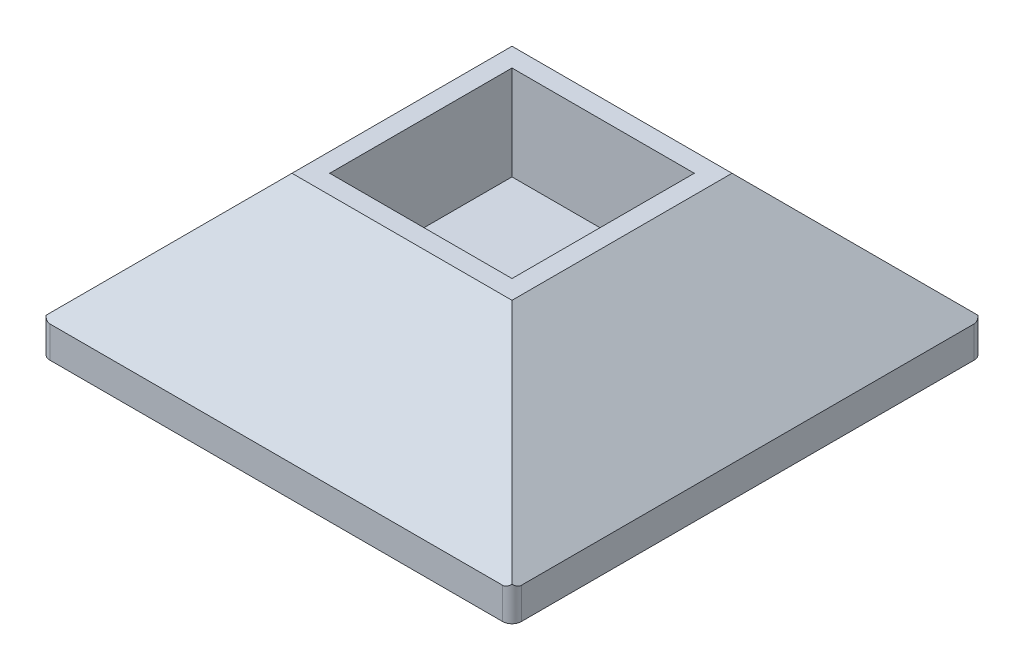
from build123d import *

# Parameters (mm, degrees)
SKETCH1_W           = 150
SKETCH1_H           = 150
BOSS_EXTRUDE1_DEPTH = 50
SKETCH2_W           = 58
SKETCH2_H           = 58
CUT_EXTRUDE1_DEPTH  = 30
CHAMFER1_SIZE       = 40
FILLET1_R           = 3


with BuildPart() as part:
    # Sketch1 → Boss-Extrude1 (new body)
    with BuildSketch(Plane(origin=(0, 0, 0), x_dir=(1, 0, 0), z_dir=(0, 1, 0))):
        with Locations((75, -75)):
            Rectangle(SKETCH1_W, SKETCH1_H)
    extrude(amount=BOSS_EXTRUDE1_DEPTH)

    # Sketch2 → Cut-Extrude1 (cut)
    with BuildSketch(Plane(origin=(0, 50, 0), x_dir=(1, 0, 0), z_dir=(0, 1, 0))):
        with Locations((75, -75)):
            Rectangle(SKETCH2_W, SKETCH2_H)
    extrude(amount=-CUT_EXTRUDE1_DEPTH, mode=Mode.SUBTRACT)

    # Chamfer1
    chamfer1_edges = [part.edges().sort_by_distance(p)[0] for p in [
        (150, 50, 75),
        (75, 50, 0),
        (0, 50, 75),
        (75, 50, 150),
    ]]
    chamfer(chamfer1_edges, length=CHAMFER1_SIZE)

    # Fillet1
    fillet1_edges = [part.edges().sort_by_distance(p)[0] for p in [
        (0, 5, 0),
        (150, 5, 0),
        (0, 5, 150),
        (150, 5, 150),
    ]]
    fillet(fillet1_edges, radius=FILLET1_R)


solid = part.part
